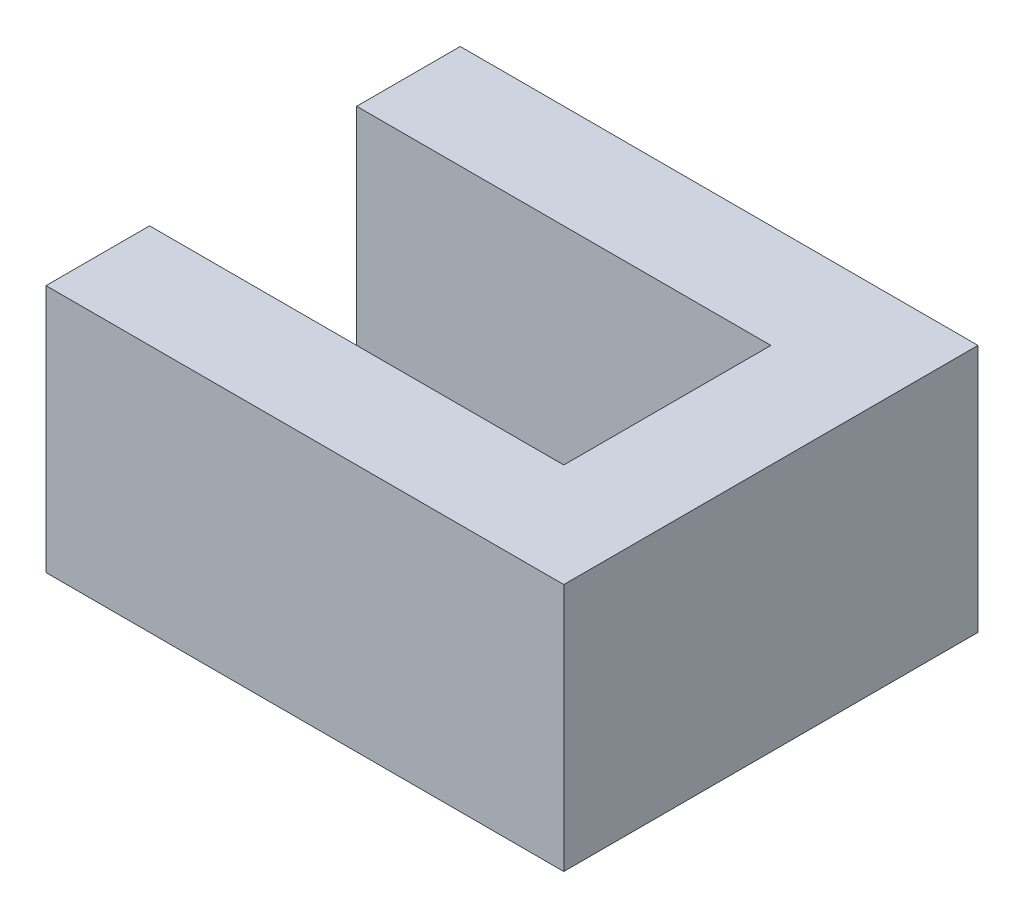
from build123d import *

# Parameters (mm, degrees)
EXTRUSION1_DEPTH = 24


with BuildPart() as part:
    # Esquisse1 → Extrusion1 (new body)
    with BuildSketch(Plane(origin=(0, 0, 0), x_dir=(1, 0, 0), z_dir=(0, 1, 0))):
        Polygon((0, 10), (-40, 10), (-40, 20), (10, 20), (10, -20), (-40, -20), (-40, -10), (0, -10), align=None)
    extrude(amount=EXTRUSION1_DEPTH)


solid = part.part
